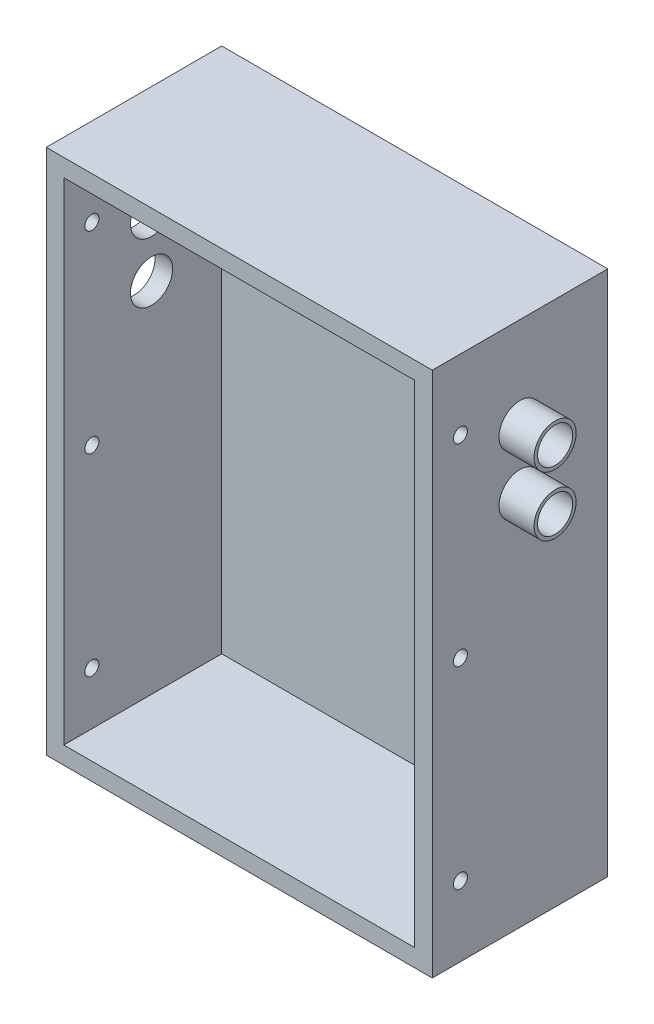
from build123d import *

# Parameters (mm, degrees)
CROQUIS1_W                        = 110
CROQUIS1_H                        = 150
SALIENTE_EXTRUIR1_DEPTH           = 50
CROQUIS2_W                        = 100
CROQUIS2_H                        = 140
CORTAR_EXTRUIR1_DEPTH             = 45
SALIENTE_EXTRUIR2_DEPTH           = 10
SALIENTE_EXTRUIR2_DEPTH_BACK      = 120
CROQUIS4_R                        = 6
CORTAR_EXTRUIR2_REACH             = 160.193
CROQUIS5_R                        = 5
CORTAR_EXTRUIR2_DIRECTION_2_DEPTH = 159.192920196
CORTAR_EXTRUIR3_DEPTH             = 151.083310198
CORTAR_EXTRUIR3_DEPTH_BACK        = 151.083310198
CROQUIS6_R                        = 2
CROQUIS7_W                        = 100
CROQUIS7_H                        = 150
SALIENTE_EXTRUIR3_DEPTH           = 45
CROQUIS8_W                        = 100
CROQUIS8_H                        = 140
CORTAR_EXTRUIR4_DEPTH             = 45
CROQUIS9_R                        = 6
CORTAR_EXTRUIR5_DEPTH             = 15


with BuildPart() as part:
    # Croquis1 → Saliente-Extruir1 (new body)
    with BuildSketch(Plane.XY):
        Rectangle(CROQUIS1_W, CROQUIS1_H)
    extrude(amount=SALIENTE_EXTRUIR1_DEPTH)

    # Croquis2 → Cortar-Extruir1 (cut)
    with BuildSketch(Plane.XY.offset(50)):
        Rectangle(CROQUIS2_W, CROQUIS2_H)
    extrude(amount=-CORTAR_EXTRUIR1_DEPTH, mode=Mode.SUBTRACT)

    # Croquis4 → Saliente-Extruir2 (add, two sides: drawn at the far end of the back side and taken through both)
    with BuildSketch(Plane.ZY.offset(55).offset(-SALIENTE_EXTRUIR2_DEPTH_BACK)):
        with Locations(Location((25, 49, 0), (0, 0, 270))):
            Circle(CROQUIS4_R)
        with Locations(Location((25, 32, 0), (0, 0, 270))):
            Circle(CROQUIS4_R)
    extrude(amount=SALIENTE_EXTRUIR2_DEPTH + SALIENTE_EXTRUIR2_DEPTH_BACK)

    # Croquis5 → Cortar-Extruir2 (cut, up to next)
    with BuildSketch(Plane.ZY.offset(65), mode=Mode.PRIVATE) as cortar_extruir2_sk1:
        with Locations(Location((25, 49, 0), (0, 0, 90))):
            Circle(CROQUIS5_R)
    cortar_extruir2_tool1 = extrude(cortar_extruir2_sk1.sketch, amount=-CORTAR_EXTRUIR2_REACH, mode=Mode.PRIVATE) & part.part
    # Croquis5 → Cortar-Extruir2 (cut, up to next)
    with BuildSketch(Plane.ZY.offset(65), mode=Mode.PRIVATE) as cortar_extruir2_sk2:
        with Locations(Location((25, 32, 0), (0, 0, 90))):
            Circle(CROQUIS5_R)
    cortar_extruir2_tool2 = extrude(cortar_extruir2_sk2.sketch, amount=-CORTAR_EXTRUIR2_REACH, mode=Mode.PRIVATE) & part.part
    add(cortar_extruir2_tool1.solids().sort_by_distance((-65, 49, 25))[0], mode=Mode.SUBTRACT)
    add(cortar_extruir2_tool2.solids().sort_by_distance((-65, 32, 25))[0], mode=Mode.SUBTRACT)

    # Croquis5 → Cortar-Extruir2 direction 2 (cut)
    with BuildSketch(Plane.ZY.offset(65)):
        with Locations(Location((25, 49, 0), (0, 0, 90))):
            Circle(CROQUIS5_R)
        with Locations(Location((25, 32, 0), (0, 0, 90))):
            Circle(CROQUIS5_R)
    extrude(amount=CORTAR_EXTRUIR2_DIRECTION_2_DEPTH, mode=Mode.SUBTRACT)

    # Croquis6 → Cortar-Extruir3 (cut, two sides: drawn at the far end of the back side and taken through both)
    with BuildSketch(Plane.ZY.offset(55).offset(-CORTAR_EXTRUIR3_DEPTH_BACK)):
        with Locations(Location((42, 55, 0), (0, 0, 270))):
            Circle(CROQUIS6_R)
        with Locations(Location((42, 0, 0), (0, 0, 270))):
            Circle(CROQUIS6_R)
        with Locations(Location((42, -55, 0), (0, 0, 270))):
            Circle(CROQUIS6_R)
    extrude(amount=CORTAR_EXTRUIR3_DEPTH + CORTAR_EXTRUIR3_DEPTH_BACK, mode=Mode.SUBTRACT)

    # Croquis7 → Saliente-Extruir3 (add)
    with BuildSketch(Plane.XY.offset(5)):
        Rectangle(CROQUIS7_W, CROQUIS7_H)
    extrude(amount=SALIENTE_EXTRUIR3_DEPTH)

    # Croquis8 → Cortar-Extruir4 (cut)
    with BuildSketch(Plane.XY.offset(50)):
        Rectangle(CROQUIS8_W, CROQUIS8_H)
    extrude(amount=-CORTAR_EXTRUIR4_DEPTH, mode=Mode.SUBTRACT)

    # Croquis9 → Cortar-Extruir5 (cut)
    with BuildSketch(Plane.ZY.offset(65)):
        with Locations(Location((25, 49, 0), (0, 0, 270))):
            Circle(CROQUIS9_R)
        with Locations(Location((25, 32, 0), (0, 0, 270))):
            Circle(CROQUIS9_R)
    extrude(amount=-CORTAR_EXTRUIR5_DEPTH, mode=Mode.SUBTRACT)


solid = part.part
